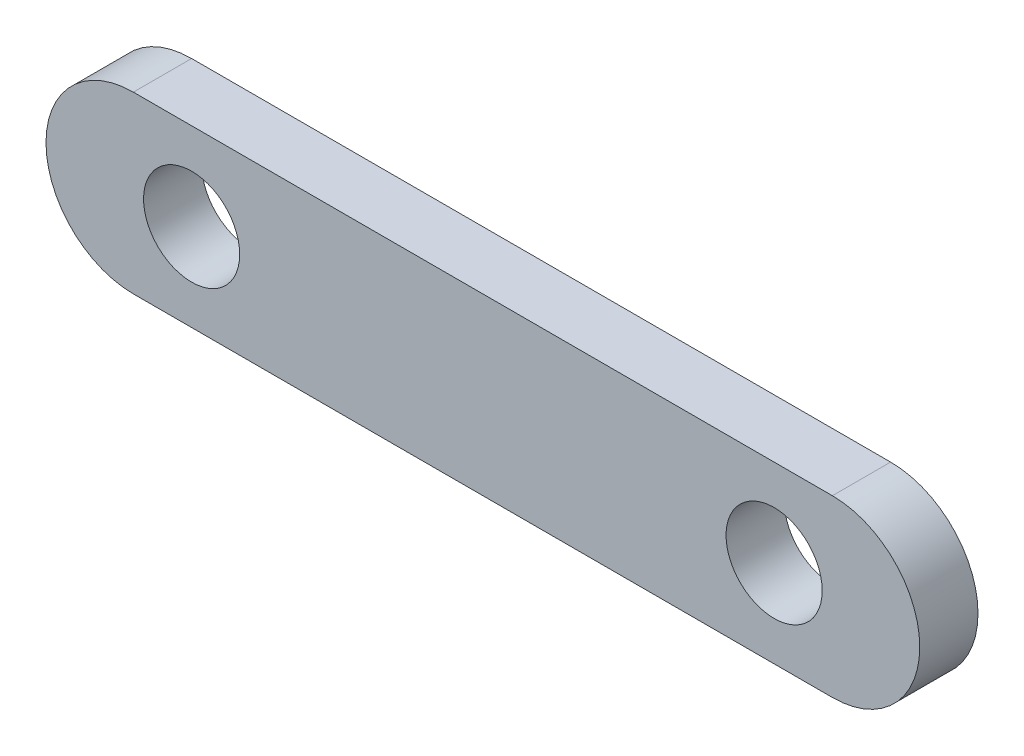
ISO-10303-21;
HEADER;
FILE_DESCRIPTION(('STEP AP214'),'2;1');
FILE_NAME('part.step','',(''),(''),'','','');
FILE_SCHEMA(('AUTOMOTIVE_DESIGN { 1 0 10303 214 1 1 1 1 }'));
ENDSEC;
DATA;
#1=APPLICATION_CONTEXT('core data for automotive mechanical design processes');
#2=APPLICATION_PROTOCOL_DEFINITION('international standard','automotive_design',2000,#1);
#3=PRODUCT_CONTEXT('',#1,'mechanical');
#4=PRODUCT('Part','Part','',(#3));
#5=PRODUCT_RELATED_PRODUCT_CATEGORY('part','',(#4));
#6=PRODUCT_DEFINITION_FORMATION('','',#4);
#7=PRODUCT_DEFINITION_CONTEXT('part definition',#1,'design');
#8=PRODUCT_DEFINITION('design','',#6,#7);
#9=PRODUCT_DEFINITION_SHAPE('','',#8);
#10=(LENGTH_UNIT() NAMED_UNIT(*) SI_UNIT(.MILLI.,.METRE.));
#11=(NAMED_UNIT(*) PLANE_ANGLE_UNIT() SI_UNIT($,.RADIAN.));
#12=(NAMED_UNIT(*) SI_UNIT($,.STERADIAN.) SOLID_ANGLE_UNIT());
#13=UNCERTAINTY_MEASURE_WITH_UNIT(LENGTH_MEASURE(1.E-05),#10,'distance_accuracy_value','');
#14=(GEOMETRIC_REPRESENTATION_CONTEXT(3) GLOBAL_UNCERTAINTY_ASSIGNED_CONTEXT((#13)) GLOBAL_UNIT_ASSIGNED_CONTEXT((#10,
#11,#12)) REPRESENTATION_CONTEXT('',''));
#15=CARTESIAN_POINT('',(0.,0.,0.));
#16=DIRECTION('',(0.,0.,1.));
#17=DIRECTION('',(1.,0.,0.));
#18=AXIS2_PLACEMENT_3D('',#15,#16,#17);
#19=CARTESIAN_POINT('',(27.,3.,2.));
#20=DIRECTION('',(0.,0.,-1.));
#21=DIRECTION('',(-1.,0.,0.));
#22=AXIS2_PLACEMENT_3D('',#19,#20,#21);
#23=CYLINDRICAL_SURFACE('',#22,3.);
#24=DIRECTION('',(0.,0.,-1.));
#25=VECTOR('',#24,1.);
#26=CARTESIAN_POINT('',(27.,6.,2.));
#27=LINE('',#26,#25);
#28=CARTESIAN_POINT('',(27.,6.,2.));
#29=VERTEX_POINT('',#28);
#30=CARTESIAN_POINT('',(27.,6.,0.));
#31=VERTEX_POINT('',#30);
#32=EDGE_CURVE('E11',#29,#31,#27,.T.);
#33=ORIENTED_EDGE('',*,*,#32,.F.);
#34=CARTESIAN_POINT('',(27.,3.,2.));
#35=DIRECTION('',(0.,0.,1.));
#36=DIRECTION('',(-1.,0.,0.));
#37=AXIS2_PLACEMENT_3D('',#34,#35,#36);
#38=CIRCLE('',#37,3.);
#39=CARTESIAN_POINT('',(27.,0.,2.));
#40=VERTEX_POINT('',#39);
#41=EDGE_CURVE('E92',#40,#29,#38,.T.);
#42=ORIENTED_EDGE('',*,*,#41,.F.);
#43=DIRECTION('',(0.,0.,1.));
#44=VECTOR('',#43,1.);
#45=CARTESIAN_POINT('',(27.,0.,2.));
#46=LINE('',#45,#44);
#47=CARTESIAN_POINT('',(27.,0.,0.));
#48=VERTEX_POINT('',#47);
#49=EDGE_CURVE('E83',#48,#40,#46,.T.);
#50=ORIENTED_EDGE('',*,*,#49,.F.);
#51=CARTESIAN_POINT('',(27.,3.,0.));
#52=DIRECTION('',(0.,0.,-1.));
#53=DIRECTION('',(-1.,0.,0.));
#54=AXIS2_PLACEMENT_3D('',#51,#52,#53);
#55=CIRCLE('',#54,3.);
#56=EDGE_CURVE('E39',#31,#48,#55,.T.);
#57=ORIENTED_EDGE('',*,*,#56,.F.);
#58=EDGE_LOOP('',(#33,#42,#50,#57));
#59=FACE_BOUND('',#58,.T.);
#60=ADVANCED_FACE('F17',(#59),#23,.T.);
#61=CARTESIAN_POINT('',(3.,3.,2.));
#62=DIRECTION('',(0.,0.,-1.));
#63=DIRECTION('',(-1.,0.,0.));
#64=AXIS2_PLACEMENT_3D('',#61,#62,#63);
#65=CYLINDRICAL_SURFACE('',#64,3.);
#66=DIRECTION('',(0.,0.,-1.));
#67=VECTOR('',#66,1.);
#68=CARTESIAN_POINT('',(3.,0.,2.));
#69=LINE('',#68,#67);
#70=CARTESIAN_POINT('',(3.,0.,2.));
#71=VERTEX_POINT('',#70);
#72=CARTESIAN_POINT('',(3.,0.,0.));
#73=VERTEX_POINT('',#72);
#74=EDGE_CURVE('E75',#71,#73,#69,.T.);
#75=ORIENTED_EDGE('',*,*,#74,.F.);
#76=CARTESIAN_POINT('',(3.,3.,2.));
#77=DIRECTION('',(0.,0.,1.));
#78=DIRECTION('',(-1.,0.,0.));
#79=AXIS2_PLACEMENT_3D('',#76,#77,#78);
#80=CIRCLE('',#79,3.);
#81=CARTESIAN_POINT('',(3.,6.,2.));
#82=VERTEX_POINT('',#81);
#83=EDGE_CURVE('E114',#82,#71,#80,.T.);
#84=ORIENTED_EDGE('',*,*,#83,.F.);
#85=DIRECTION('',(0.,0.,1.));
#86=VECTOR('',#85,1.);
#87=CARTESIAN_POINT('',(3.,6.,2.));
#88=LINE('',#87,#86);
#89=CARTESIAN_POINT('',(3.,6.,0.));
#90=VERTEX_POINT('',#89);
#91=EDGE_CURVE('E26',#90,#82,#88,.T.);
#92=ORIENTED_EDGE('',*,*,#91,.F.);
#93=CARTESIAN_POINT('',(3.,3.,0.));
#94=DIRECTION('',(0.,0.,-1.));
#95=DIRECTION('',(-1.,0.,0.));
#96=AXIS2_PLACEMENT_3D('',#93,#94,#95);
#97=CIRCLE('',#96,3.);
#98=EDGE_CURVE('E65',#73,#90,#97,.T.);
#99=ORIENTED_EDGE('',*,*,#98,.F.);
#100=EDGE_LOOP('',(#75,#84,#92,#99));
#101=FACE_BOUND('',#100,.T.);
#102=ADVANCED_FACE('F88',(#101),#65,.T.);
#103=CARTESIAN_POINT('',(0.,6.,2.));
#104=DIRECTION('',(0.,-1.,0.));
#105=DIRECTION('',(0.,0.,-1.));
#106=AXIS2_PLACEMENT_3D('',#103,#104,#105);
#107=PLANE('',#106);
#108=DIRECTION('',(-1.,0.,0.));
#109=VECTOR('',#108,1.);
#110=CARTESIAN_POINT('',(0.,6.,0.));
#111=LINE('',#110,#109);
#112=EDGE_CURVE('E91',#31,#90,#111,.T.);
#113=ORIENTED_EDGE('',*,*,#112,.T.);
#114=ORIENTED_EDGE('',*,*,#91,.T.);
#115=DIRECTION('',(-1.,0.,0.));
#116=VECTOR('',#115,1.);
#117=CARTESIAN_POINT('',(0.,6.,2.));
#118=LINE('',#117,#116);
#119=EDGE_CURVE('E113',#29,#82,#118,.T.);
#120=ORIENTED_EDGE('',*,*,#119,.F.);
#121=ORIENTED_EDGE('',*,*,#32,.T.);
#122=EDGE_LOOP('',(#113,#114,#120,#121));
#123=FACE_BOUND('',#122,.T.);
#124=ADVANCED_FACE('F111',(#123),#107,.F.);
#125=CARTESIAN_POINT('',(0.,0.,2.));
#126=DIRECTION('',(0.,1.,0.));
#127=DIRECTION('',(1.,0.,0.));
#128=AXIS2_PLACEMENT_3D('',#125,#126,#127);
#129=PLANE('',#128);
#130=DIRECTION('',(1.,0.,0.));
#131=VECTOR('',#130,1.);
#132=CARTESIAN_POINT('',(0.,0.,2.));
#133=LINE('',#132,#131);
#134=EDGE_CURVE('E79',#71,#40,#133,.T.);
#135=ORIENTED_EDGE('',*,*,#134,.F.);
#136=ORIENTED_EDGE('',*,*,#74,.T.);
#137=DIRECTION('',(1.,0.,0.));
#138=VECTOR('',#137,1.);
#139=CARTESIAN_POINT('',(0.,0.,0.));
#140=LINE('',#139,#138);
#141=EDGE_CURVE('E77',#73,#48,#140,.T.);
#142=ORIENTED_EDGE('',*,*,#141,.T.);
#143=ORIENTED_EDGE('',*,*,#49,.T.);
#144=EDGE_LOOP('',(#135,#136,#142,#143));
#145=FACE_BOUND('',#144,.T.);
#146=ADVANCED_FACE('F76',(#145),#129,.F.);
#147=CARTESIAN_POINT('',(0.,0.,0.));
#148=DIRECTION('',(0.,0.,-1.));
#149=DIRECTION('',(0.,-1.,0.));
#150=AXIS2_PLACEMENT_3D('',#147,#148,#149);
#151=PLANE('',#150);
#152=CARTESIAN_POINT('',(25.,3.,0.));
#153=DIRECTION('',(0.,0.,1.));
#154=DIRECTION('',(1.,0.,0.));
#155=AXIS2_PLACEMENT_3D('',#152,#153,#154);
#156=CIRCLE('',#155,1.65);
#157=CARTESIAN_POINT('',(26.65,3.,0.));
#158=VERTEX_POINT('',#157);
#159=EDGE_CURVE('E135',#158,#158,#156,.T.);
#160=ORIENTED_EDGE('',*,*,#159,.T.);
#161=EDGE_LOOP('',(#160));
#162=FACE_BOUND('',#161,.T.);
#163=CARTESIAN_POINT('',(5.,3.,0.));
#164=DIRECTION('',(0.,0.,1.));
#165=DIRECTION('',(1.,0.,0.));
#166=AXIS2_PLACEMENT_3D('',#163,#164,#165);
#167=CIRCLE('',#166,1.65);
#168=CARTESIAN_POINT('',(6.65,3.,0.));
#169=VERTEX_POINT('',#168);
#170=EDGE_CURVE('E121',#169,#169,#167,.T.);
#171=ORIENTED_EDGE('',*,*,#170,.T.);
#172=EDGE_LOOP('',(#171));
#173=FACE_BOUND('',#172,.T.);
#174=ORIENTED_EDGE('',*,*,#98,.T.);
#175=ORIENTED_EDGE('',*,*,#112,.F.);
#176=ORIENTED_EDGE('',*,*,#56,.T.);
#177=ORIENTED_EDGE('',*,*,#141,.F.);
#178=EDGE_LOOP('',(#174,#175,#176,#177));
#179=FACE_BOUND('',#178,.T.);
#180=ADVANCED_FACE('F85',(#162,#173,#179),#151,.T.);
#181=CARTESIAN_POINT('',(0.,0.,2.));
#182=DIRECTION('',(0.,0.,-1.));
#183=DIRECTION('',(0.,-1.,0.));
#184=AXIS2_PLACEMENT_3D('',#181,#182,#183);
#185=PLANE('',#184);
#186=CARTESIAN_POINT('',(25.,3.,2.));
#187=DIRECTION('',(0.,0.,1.));
#188=DIRECTION('',(1.,0.,0.));
#189=AXIS2_PLACEMENT_3D('',#186,#187,#188);
#190=CIRCLE('',#189,1.65);
#191=CARTESIAN_POINT('',(26.65,3.,2.));
#192=VERTEX_POINT('',#191);
#193=EDGE_CURVE('E141',#192,#192,#190,.T.);
#194=ORIENTED_EDGE('',*,*,#193,.F.);
#195=EDGE_LOOP('',(#194));
#196=FACE_BOUND('',#195,.T.);
#197=CARTESIAN_POINT('',(5.,3.,2.));
#198=DIRECTION('',(0.,0.,1.));
#199=DIRECTION('',(1.,0.,0.));
#200=AXIS2_PLACEMENT_3D('',#197,#198,#199);
#201=CIRCLE('',#200,1.65);
#202=CARTESIAN_POINT('',(6.65,3.,2.));
#203=VERTEX_POINT('',#202);
#204=EDGE_CURVE('E129',#203,#203,#201,.T.);
#205=ORIENTED_EDGE('',*,*,#204,.F.);
#206=EDGE_LOOP('',(#205));
#207=FACE_BOUND('',#206,.T.);
#208=ORIENTED_EDGE('',*,*,#119,.T.);
#209=ORIENTED_EDGE('',*,*,#83,.T.);
#210=ORIENTED_EDGE('',*,*,#134,.T.);
#211=ORIENTED_EDGE('',*,*,#41,.T.);
#212=EDGE_LOOP('',(#208,#209,#210,#211));
#213=FACE_BOUND('',#212,.T.);
#214=ADVANCED_FACE('F117',(#196,#207,#213),#185,.F.);
#215=CARTESIAN_POINT('',(5.,3.,2.));
#216=DIRECTION('',(0.,0.,-1.));
#217=DIRECTION('',(-1.,0.,0.));
#218=AXIS2_PLACEMENT_3D('',#215,#216,#217);
#219=CYLINDRICAL_SURFACE('',#218,1.65);
#220=ORIENTED_EDGE('',*,*,#170,.F.);
#221=EDGE_LOOP('',(#220));
#222=FACE_BOUND('',#221,.T.);
#223=ORIENTED_EDGE('',*,*,#204,.T.);
#224=EDGE_LOOP('',(#223));
#225=FACE_BOUND('',#224,.T.);
#226=ADVANCED_FACE('F152',(#222,#225),#219,.F.);
#227=CARTESIAN_POINT('',(25.,3.,2.));
#228=DIRECTION('',(0.,0.,-1.));
#229=DIRECTION('',(-1.,0.,0.));
#230=AXIS2_PLACEMENT_3D('',#227,#228,#229);
#231=CYLINDRICAL_SURFACE('',#230,1.65);
#232=ORIENTED_EDGE('',*,*,#159,.F.);
#233=EDGE_LOOP('',(#232));
#234=FACE_BOUND('',#233,.T.);
#235=ORIENTED_EDGE('',*,*,#193,.T.);
#236=EDGE_LOOP('',(#235));
#237=FACE_BOUND('',#236,.T.);
#238=ADVANCED_FACE('F148',(#234,#237),#231,.F.);
#239=CLOSED_SHELL('',(#60,#102,#124,#146,#180,#214,#226,#238));
#240=MANIFOLD_SOLID_BREP('B1',#239);
#241=ADVANCED_BREP_SHAPE_REPRESENTATION('',(#18,#240),#14);
#242=SHAPE_DEFINITION_REPRESENTATION(#9,#241);
ENDSEC;
END-ISO-10303-21;
